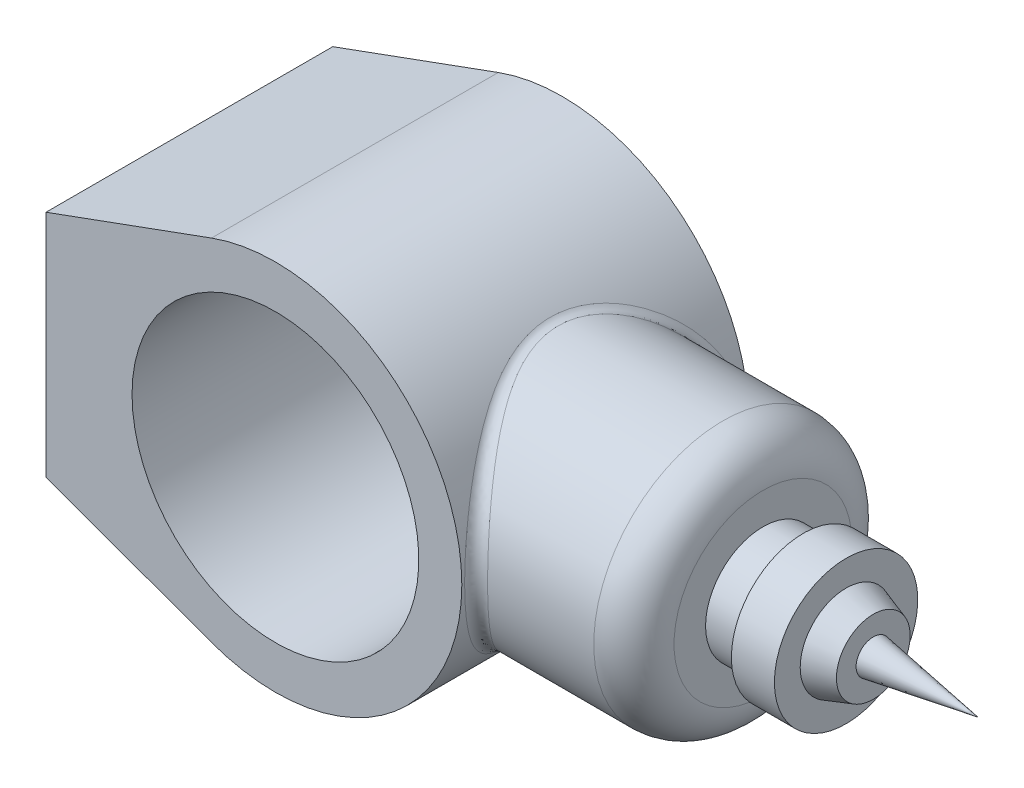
from build123d import *

# Parameters (mm, degrees)
SKETCH1_R                = 50
BOSS_EXTRUDE1_DEPTH      = 50
BOSS_EXTRUDE2_REACH      = 218.16
BOSS_EXTRUDE2_END_RADIUS = 65
SKETCH2_R                = 45
FILLET1_R                = 4
FILLET2_R                = 14


with BuildPart() as part:
    # Sketch1 → Boss-Extrude1 (new, symmetric)
    with BuildSketch(Plane.XY):
        with BuildLine():
            Line((-80, -40), (-80, 40))
            Line((-80, 40), (-22.281665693, 61.061668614))
            ThreePointArc((-22.281665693, 61.061668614), (65, 0), (-22.281665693, -61.061668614))
            Line((-22.281665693, -61.061668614), (-80, -40))
        make_face()
        with Locations(Location((0, 0, 0), (0, 0, 180))):
            Circle(SKETCH1_R, mode=Mode.SUBTRACT)
    extrude(amount=BOSS_EXTRUDE1_DEPTH, both=True)

    # Boss-Extrude2: up to this cylinder (the profile starts outside it)
    boss_extrude2_end = Plane(origin=(0, 0, 0), z_dir=(0, 0, -1)) * Cylinder(BOSS_EXTRUDE2_END_RADIUS, 567.32, mode=Mode.PRIVATE)
    # Sketch2 → Boss-Extrude2 (add, up to the surface)
    with BuildSketch(Plane(origin=(120, 0, 0), x_dir=(0, 0, -1), z_dir=(1, 0, 0)), mode=Mode.PRIVATE) as boss_extrude2_sk1:
        Circle(SKETCH2_R)
    boss_extrude2_tool1 = extrude(boss_extrude2_sk1.sketch, amount=-BOSS_EXTRUDE2_REACH, mode=Mode.PRIVATE) - boss_extrude2_end
    add(boss_extrude2_tool1.solids().sort_by_distance((120, 0, 0))[0])

    # Sketch3 → Revolve1 (revolve)
    with BuildSketch(Plane.XY, mode=Mode.PRIVATE) as revolve1_sk:
        Polygon((120, 0), (120, -20), (134, -20), (134, -25), (149, -25), (149, -16), (158.489727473, -12.846419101), (158.489727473, -6), (195, 0), align=None)
    revolve(revolve1_sk.sketch.rotate(Axis((-119.215437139, 0, 0), (1, 0, 0)), 270), axis=Axis((-119.215437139, 0, 0), (1, 0, 0)))

    # Fillet1
    fillet1_edges = [part.edges().sort_by_distance(p)[0] for p in [
        (65, 0, 45),
    ]]
    fillet(fillet1_edges, radius=FILLET1_R)

    # Fillet2
    fillet2_edges = [part.edges().sort_by_distance(p)[0] for p in [
        (120, 0, 45),
    ]]
    fillet(fillet2_edges, radius=FILLET2_R)


solid = part.part
